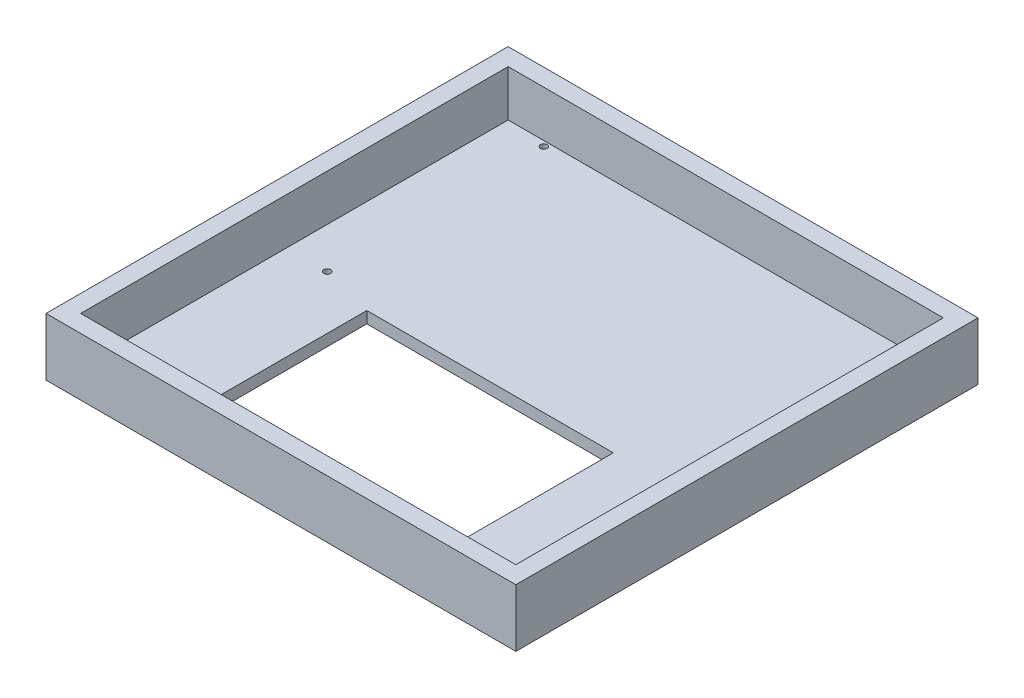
ISO-10303-21;
HEADER;
FILE_DESCRIPTION(('STEP AP214'),'2;1');
FILE_NAME('part.step','',(''),(''),'','','');
FILE_SCHEMA(('AUTOMOTIVE_DESIGN { 1 0 10303 214 1 1 1 1 }'));
ENDSEC;
DATA;
#1=APPLICATION_CONTEXT('core data for automotive mechanical design processes');
#2=APPLICATION_PROTOCOL_DEFINITION('international standard','automotive_design',2000,#1);
#3=PRODUCT_CONTEXT('',#1,'mechanical');
#4=PRODUCT('Part','Part','',(#3));
#5=PRODUCT_RELATED_PRODUCT_CATEGORY('part','',(#4));
#6=PRODUCT_DEFINITION_FORMATION('','',#4);
#7=PRODUCT_DEFINITION_CONTEXT('part definition',#1,'design');
#8=PRODUCT_DEFINITION('design','',#6,#7);
#9=PRODUCT_DEFINITION_SHAPE('','',#8);
#10=(LENGTH_UNIT() NAMED_UNIT(*) SI_UNIT(.MILLI.,.METRE.));
#11=(NAMED_UNIT(*) PLANE_ANGLE_UNIT() SI_UNIT($,.RADIAN.));
#12=(NAMED_UNIT(*) SI_UNIT($,.STERADIAN.) SOLID_ANGLE_UNIT());
#13=UNCERTAINTY_MEASURE_WITH_UNIT(LENGTH_MEASURE(1.E-05),#10,'distance_accuracy_value','');
#14=(GEOMETRIC_REPRESENTATION_CONTEXT(3) GLOBAL_UNCERTAINTY_ASSIGNED_CONTEXT((#13)) GLOBAL_UNIT_ASSIGNED_CONTEXT((#10,
#11,#12)) REPRESENTATION_CONTEXT('',''));
#15=CARTESIAN_POINT('',(0.,0.,0.));
#16=DIRECTION('',(0.,0.,1.));
#17=DIRECTION('',(1.,0.,0.));
#18=AXIS2_PLACEMENT_3D('',#15,#16,#17);
#19=CARTESIAN_POINT('',(0.,15.,0.));
#20=DIRECTION('',(0.,1.,0.));
#21=DIRECTION('',(0.,0.,1.));
#22=AXIS2_PLACEMENT_3D('',#19,#20,#21);
#23=PLANE('',#22);
#24=DIRECTION('',(0.,0.,1.));
#25=VECTOR('',#24,1.);
#26=CARTESIAN_POINT('',(-61.,15.,60.));
#27=LINE('',#26,#25);
#28=CARTESIAN_POINT('',(-61.,15.,-60.));
#29=VERTEX_POINT('',#28);
#30=CARTESIAN_POINT('',(-61.,15.,60.));
#31=VERTEX_POINT('',#30);
#32=EDGE_CURVE('E185',#29,#31,#27,.T.);
#33=ORIENTED_EDGE('',*,*,#32,.T.);
#34=DIRECTION('',(1.,0.,0.));
#35=VECTOR('',#34,1.);
#36=CARTESIAN_POINT('',(61.,15.,60.));
#37=LINE('',#36,#35);
#38=CARTESIAN_POINT('',(61.,15.,60.));
#39=VERTEX_POINT('',#38);
#40=EDGE_CURVE('E188',#31,#39,#37,.T.);
#41=ORIENTED_EDGE('',*,*,#40,.T.);
#42=DIRECTION('',(0.,0.,-1.));
#43=VECTOR('',#42,1.);
#44=CARTESIAN_POINT('',(61.,15.,60.));
#45=LINE('',#44,#43);
#46=CARTESIAN_POINT('',(61.,15.,-60.));
#47=VERTEX_POINT('',#46);
#48=EDGE_CURVE('E191',#39,#47,#45,.T.);
#49=ORIENTED_EDGE('',*,*,#48,.T.);
#50=DIRECTION('',(-1.,0.,0.));
#51=VECTOR('',#50,1.);
#52=CARTESIAN_POINT('',(61.,15.,-60.));
#53=LINE('',#52,#51);
#54=EDGE_CURVE('E193',#47,#29,#53,.T.);
#55=ORIENTED_EDGE('',*,*,#54,.T.);
#56=EDGE_LOOP('',(#33,#41,#49,#55));
#57=FACE_BOUND('',#56,.T.);
#58=DIRECTION('',(0.,0.,-1.));
#59=VECTOR('',#58,1.);
#60=CARTESIAN_POINT('',(56.5,15.,55.5));
#61=LINE('',#60,#59);
#62=CARTESIAN_POINT('',(56.5,15.,55.5));
#63=VERTEX_POINT('',#62);
#64=CARTESIAN_POINT('',(56.5,15.,-55.5));
#65=VERTEX_POINT('',#64);
#66=EDGE_CURVE('E156',#63,#65,#61,.T.);
#67=ORIENTED_EDGE('',*,*,#66,.F.);
#68=DIRECTION('',(-1.,0.,0.));
#69=VECTOR('',#68,1.);
#70=CARTESIAN_POINT('',(56.5,15.,55.5));
#71=LINE('',#70,#69);
#72=CARTESIAN_POINT('',(-56.5,15.,55.5));
#73=VERTEX_POINT('',#72);
#74=EDGE_CURVE('E149',#63,#73,#71,.T.);
#75=ORIENTED_EDGE('',*,*,#74,.T.);
#76=DIRECTION('',(0.,0.,-1.));
#77=VECTOR('',#76,1.);
#78=CARTESIAN_POINT('',(-56.5,15.,55.5));
#79=LINE('',#78,#77);
#80=CARTESIAN_POINT('',(-56.5,15.,-55.5));
#81=VERTEX_POINT('',#80);
#82=EDGE_CURVE('E167',#73,#81,#79,.T.);
#83=ORIENTED_EDGE('',*,*,#82,.T.);
#84=DIRECTION('',(-1.,0.,0.));
#85=VECTOR('',#84,1.);
#86=CARTESIAN_POINT('',(56.5,15.,-55.5));
#87=LINE('',#86,#85);
#88=EDGE_CURVE('E170',#65,#81,#87,.T.);
#89=ORIENTED_EDGE('',*,*,#88,.F.);
#90=EDGE_LOOP('',(#67,#75,#83,#89));
#91=FACE_BOUND('',#90,.T.);
#92=ADVANCED_FACE('F34',(#57,#91),#23,.T.);
#93=CARTESIAN_POINT('',(-61.,15.,60.));
#94=DIRECTION('',(1.,0.,0.));
#95=DIRECTION('',(0.,0.,-1.));
#96=AXIS2_PLACEMENT_3D('',#93,#94,#95);
#97=PLANE('',#96);
#98=DIRECTION('',(0.,0.,1.));
#99=VECTOR('',#98,1.);
#100=CARTESIAN_POINT('',(-61.,0.,60.));
#101=LINE('',#100,#99);
#102=CARTESIAN_POINT('',(-61.,0.,-60.));
#103=VERTEX_POINT('',#102);
#104=CARTESIAN_POINT('',(-61.,0.,60.));
#105=VERTEX_POINT('',#104);
#106=EDGE_CURVE('E184',#103,#105,#101,.T.);
#107=ORIENTED_EDGE('',*,*,#106,.T.);
#108=DIRECTION('',(0.,-1.,0.));
#109=VECTOR('',#108,1.);
#110=CARTESIAN_POINT('',(-61.,15.,60.));
#111=LINE('',#110,#109);
#112=EDGE_CURVE('E211',#31,#105,#111,.T.);
#113=ORIENTED_EDGE('',*,*,#112,.F.);
#114=ORIENTED_EDGE('',*,*,#32,.F.);
#115=DIRECTION('',(0.,-1.,0.));
#116=VECTOR('',#115,1.);
#117=CARTESIAN_POINT('',(-61.,15.,-60.));
#118=LINE('',#117,#116);
#119=EDGE_CURVE('E195',#29,#103,#118,.T.);
#120=ORIENTED_EDGE('',*,*,#119,.T.);
#121=EDGE_LOOP('',(#107,#113,#114,#120));
#122=FACE_BOUND('',#121,.T.);
#123=ADVANCED_FACE('F36',(#122),#97,.F.);
#124=CARTESIAN_POINT('',(61.,15.,60.));
#125=DIRECTION('',(0.,0.,-1.));
#126=DIRECTION('',(-1.,0.,0.));
#127=AXIS2_PLACEMENT_3D('',#124,#125,#126);
#128=PLANE('',#127);
#129=DIRECTION('',(1.,0.,0.));
#130=VECTOR('',#129,1.);
#131=CARTESIAN_POINT('',(61.,0.,60.));
#132=LINE('',#131,#130);
#133=CARTESIAN_POINT('',(61.,0.,60.));
#134=VERTEX_POINT('',#133);
#135=EDGE_CURVE('E198',#105,#134,#132,.T.);
#136=ORIENTED_EDGE('',*,*,#135,.T.);
#137=DIRECTION('',(0.,-1.,0.));
#138=VECTOR('',#137,1.);
#139=CARTESIAN_POINT('',(61.,15.,60.));
#140=LINE('',#139,#138);
#141=EDGE_CURVE('E208',#39,#134,#140,.T.);
#142=ORIENTED_EDGE('',*,*,#141,.F.);
#143=ORIENTED_EDGE('',*,*,#40,.F.);
#144=ORIENTED_EDGE('',*,*,#112,.T.);
#145=EDGE_LOOP('',(#136,#142,#143,#144));
#146=FACE_BOUND('',#145,.T.);
#147=ADVANCED_FACE('F241',(#146),#128,.F.);
#148=CARTESIAN_POINT('',(61.,15.,60.));
#149=DIRECTION('',(-1.,0.,0.));
#150=DIRECTION('',(0.,0.,1.));
#151=AXIS2_PLACEMENT_3D('',#148,#149,#150);
#152=PLANE('',#151);
#153=DIRECTION('',(0.,0.,-1.));
#154=VECTOR('',#153,1.);
#155=CARTESIAN_POINT('',(61.,0.,60.));
#156=LINE('',#155,#154);
#157=CARTESIAN_POINT('',(61.,0.,-60.));
#158=VERTEX_POINT('',#157);
#159=EDGE_CURVE('E200',#134,#158,#156,.T.);
#160=ORIENTED_EDGE('',*,*,#159,.T.);
#161=DIRECTION('',(0.,-1.,0.));
#162=VECTOR('',#161,1.);
#163=CARTESIAN_POINT('',(61.,15.,-60.));
#164=LINE('',#163,#162);
#165=EDGE_CURVE('E205',#47,#158,#164,.T.);
#166=ORIENTED_EDGE('',*,*,#165,.F.);
#167=ORIENTED_EDGE('',*,*,#48,.F.);
#168=ORIENTED_EDGE('',*,*,#141,.T.);
#169=EDGE_LOOP('',(#160,#166,#167,#168));
#170=FACE_BOUND('',#169,.T.);
#171=ADVANCED_FACE('F254',(#170),#152,.F.);
#172=CARTESIAN_POINT('',(61.,15.,-60.));
#173=DIRECTION('',(0.,0.,1.));
#174=DIRECTION('',(1.,0.,0.));
#175=AXIS2_PLACEMENT_3D('',#172,#173,#174);
#176=PLANE('',#175);
#177=DIRECTION('',(-1.,0.,0.));
#178=VECTOR('',#177,1.);
#179=CARTESIAN_POINT('',(61.,0.,-60.));
#180=LINE('',#179,#178);
#181=EDGE_CURVE('E189',#158,#103,#180,.T.);
#182=ORIENTED_EDGE('',*,*,#181,.T.);
#183=ORIENTED_EDGE('',*,*,#119,.F.);
#184=ORIENTED_EDGE('',*,*,#54,.F.);
#185=ORIENTED_EDGE('',*,*,#165,.T.);
#186=EDGE_LOOP('',(#182,#183,#184,#185));
#187=FACE_BOUND('',#186,.T.);
#188=ADVANCED_FACE('F250',(#187),#176,.F.);
#189=CARTESIAN_POINT('',(0.,0.,0.));
#190=DIRECTION('',(0.,1.,0.));
#191=DIRECTION('',(0.,0.,1.));
#192=AXIS2_PLACEMENT_3D('',#189,#190,#191);
#193=PLANE('',#192);
#194=CARTESIAN_POINT('',(-45.8978,0.,2.06199999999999));
#195=DIRECTION('',(0.,1.,0.));
#196=DIRECTION('',(0.,0.,1.));
#197=AXIS2_PLACEMENT_3D('',#194,#195,#196);
#198=CIRCLE('',#197,0.876299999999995);
#199=CARTESIAN_POINT('',(-45.8978,0.,2.93829999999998));
#200=VERTEX_POINT('',#199);
#201=EDGE_CURVE('E390',#200,#200,#198,.T.);
#202=ORIENTED_EDGE('',*,*,#201,.T.);
#203=EDGE_LOOP('',(#202));
#204=FACE_BOUND('',#203,.T.);
#205=CARTESIAN_POINT('',(45.8978,0.,2.06199999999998));
#206=DIRECTION('',(0.,1.,0.));
#207=DIRECTION('',(0.,0.,1.));
#208=AXIS2_PLACEMENT_3D('',#205,#206,#207);
#209=CIRCLE('',#208,0.876299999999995);
#210=CARTESIAN_POINT('',(45.8978,0.,2.93829999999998));
#211=VERTEX_POINT('',#210);
#212=EDGE_CURVE('E394',#211,#211,#209,.T.);
#213=ORIENTED_EDGE('',*,*,#212,.T.);
#214=EDGE_LOOP('',(#213));
#215=FACE_BOUND('',#214,.T.);
#216=CARTESIAN_POINT('',(45.8978,0.,-54.1736));
#217=DIRECTION('',(0.,1.,0.));
#218=DIRECTION('',(0.,0.,1.));
#219=AXIS2_PLACEMENT_3D('',#216,#217,#218);
#220=CIRCLE('',#219,0.876299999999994);
#221=CARTESIAN_POINT('',(45.8978,0.,-53.2973));
#222=VERTEX_POINT('',#221);
#223=EDGE_CURVE('E404',#222,#222,#220,.T.);
#224=ORIENTED_EDGE('',*,*,#223,.T.);
#225=EDGE_LOOP('',(#224));
#226=FACE_BOUND('',#225,.T.);
#227=CARTESIAN_POINT('',(-45.8978,0.,-54.1736));
#228=DIRECTION('',(0.,1.,0.));
#229=DIRECTION('',(0.,0.,1.));
#230=AXIS2_PLACEMENT_3D('',#227,#228,#229);
#231=CIRCLE('',#230,0.876299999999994);
#232=CARTESIAN_POINT('',(-45.8978,0.,-53.2973));
#233=VERTEX_POINT('',#232);
#234=EDGE_CURVE('E410',#233,#233,#231,.T.);
#235=ORIENTED_EDGE('',*,*,#234,.T.);
#236=EDGE_LOOP('',(#235));
#237=FACE_BOUND('',#236,.T.);
#238=DIRECTION('',(1.,0.,0.));
#239=VECTOR('',#238,1.);
#240=CARTESIAN_POINT('',(32.,0.,5.69419999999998));
#241=LINE('',#240,#239);
#242=CARTESIAN_POINT('',(-32.,0.,5.69419999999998));
#243=VERTEX_POINT('',#242);
#244=CARTESIAN_POINT('',(32.,0.,5.69419999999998));
#245=VERTEX_POINT('',#244);
#246=EDGE_CURVE('E135',#243,#245,#241,.T.);
#247=ORIENTED_EDGE('',*,*,#246,.F.);
#248=DIRECTION('',(0.,0.,-1.));
#249=VECTOR('',#248,1.);
#250=CARTESIAN_POINT('',(-32.,0.,51.6942));
#251=LINE('',#250,#249);
#252=CARTESIAN_POINT('',(-32.,0.,51.6942));
#253=VERTEX_POINT('',#252);
#254=EDGE_CURVE('E49',#253,#243,#251,.T.);
#255=ORIENTED_EDGE('',*,*,#254,.F.);
#256=DIRECTION('',(-1.,0.,0.));
#257=VECTOR('',#256,1.);
#258=CARTESIAN_POINT('',(32.,0.,51.6942));
#259=LINE('',#258,#257);
#260=CARTESIAN_POINT('',(32.,0.,51.6942));
#261=VERTEX_POINT('',#260);
#262=EDGE_CURVE('E142',#261,#253,#259,.T.);
#263=ORIENTED_EDGE('',*,*,#262,.F.);
#264=DIRECTION('',(0.,0.,1.));
#265=VECTOR('',#264,1.);
#266=CARTESIAN_POINT('',(32.,0.,51.6942));
#267=LINE('',#266,#265);
#268=EDGE_CURVE('E126',#245,#261,#267,.T.);
#269=ORIENTED_EDGE('',*,*,#268,.F.);
#270=EDGE_LOOP('',(#247,#255,#263,#269));
#271=FACE_BOUND('',#270,.T.);
#272=ORIENTED_EDGE('',*,*,#106,.F.);
#273=ORIENTED_EDGE('',*,*,#181,.F.);
#274=ORIENTED_EDGE('',*,*,#159,.F.);
#275=ORIENTED_EDGE('',*,*,#135,.F.);
#276=EDGE_LOOP('',(#272,#273,#274,#275));
#277=FACE_BOUND('',#276,.T.);
#278=ADVANCED_FACE('F139',(#204,#215,#226,#237,#271,#277),#193,.F.);
#279=CARTESIAN_POINT('',(56.5,3.,55.5));
#280=DIRECTION('',(0.,0.,-1.));
#281=DIRECTION('',(-1.,0.,0.));
#282=AXIS2_PLACEMENT_3D('',#279,#280,#281);
#283=PLANE('',#282);
#284=ORIENTED_EDGE('',*,*,#74,.F.);
#285=DIRECTION('',(0.,1.,0.));
#286=VECTOR('',#285,1.);
#287=CARTESIAN_POINT('',(56.5,3.,55.5));
#288=LINE('',#287,#286);
#289=CARTESIAN_POINT('',(56.5,3.,55.5));
#290=VERTEX_POINT('',#289);
#291=EDGE_CURVE('E164',#290,#63,#288,.T.);
#292=ORIENTED_EDGE('',*,*,#291,.F.);
#293=DIRECTION('',(-1.,0.,0.));
#294=VECTOR('',#293,1.);
#295=CARTESIAN_POINT('',(56.5,3.,55.5));
#296=LINE('',#295,#294);
#297=CARTESIAN_POINT('',(-56.5,3.,55.5));
#298=VERTEX_POINT('',#297);
#299=EDGE_CURVE('E152',#290,#298,#296,.T.);
#300=ORIENTED_EDGE('',*,*,#299,.T.);
#301=DIRECTION('',(0.,1.,0.));
#302=VECTOR('',#301,1.);
#303=CARTESIAN_POINT('',(-56.5,3.,55.5));
#304=LINE('',#303,#302);
#305=EDGE_CURVE('E181',#298,#73,#304,.T.);
#306=ORIENTED_EDGE('',*,*,#305,.T.);
#307=EDGE_LOOP('',(#284,#292,#300,#306));
#308=FACE_BOUND('',#307,.T.);
#309=ADVANCED_FACE('F246',(#308),#283,.T.);
#310=CARTESIAN_POINT('',(-56.5,3.,55.5));
#311=DIRECTION('',(1.,0.,0.));
#312=DIRECTION('',(0.,0.,-1.));
#313=AXIS2_PLACEMENT_3D('',#310,#311,#312);
#314=PLANE('',#313);
#315=ORIENTED_EDGE('',*,*,#82,.F.);
#316=ORIENTED_EDGE('',*,*,#305,.F.);
#317=DIRECTION('',(0.,0.,-1.));
#318=VECTOR('',#317,1.);
#319=CARTESIAN_POINT('',(-56.5,3.,55.5));
#320=LINE('',#319,#318);
#321=CARTESIAN_POINT('',(-56.5,3.,-55.5));
#322=VERTEX_POINT('',#321);
#323=EDGE_CURVE('E155',#298,#322,#320,.T.);
#324=ORIENTED_EDGE('',*,*,#323,.T.);
#325=DIRECTION('',(0.,1.,0.));
#326=VECTOR('',#325,1.);
#327=CARTESIAN_POINT('',(-56.5,3.,-55.5));
#328=LINE('',#327,#326);
#329=EDGE_CURVE('E179',#322,#81,#328,.T.);
#330=ORIENTED_EDGE('',*,*,#329,.T.);
#331=EDGE_LOOP('',(#315,#316,#324,#330));
#332=FACE_BOUND('',#331,.T.);
#333=ADVANCED_FACE('F294',(#332),#314,.T.);
#334=CARTESIAN_POINT('',(56.5,3.,-55.5));
#335=DIRECTION('',(0.,0.,-1.));
#336=DIRECTION('',(-1.,0.,0.));
#337=AXIS2_PLACEMENT_3D('',#334,#335,#336);
#338=PLANE('',#337);
#339=ORIENTED_EDGE('',*,*,#88,.T.);
#340=ORIENTED_EDGE('',*,*,#329,.F.);
#341=DIRECTION('',(-1.,0.,0.));
#342=VECTOR('',#341,1.);
#343=CARTESIAN_POINT('',(56.5,3.,-55.5));
#344=LINE('',#343,#342);
#345=CARTESIAN_POINT('',(56.5,3.,-55.5));
#346=VERTEX_POINT('',#345);
#347=EDGE_CURVE('E158',#346,#322,#344,.T.);
#348=ORIENTED_EDGE('',*,*,#347,.F.);
#349=DIRECTION('',(0.,1.,0.));
#350=VECTOR('',#349,1.);
#351=CARTESIAN_POINT('',(56.5,3.,-55.5));
#352=LINE('',#351,#350);
#353=EDGE_CURVE('E177',#346,#65,#352,.T.);
#354=ORIENTED_EDGE('',*,*,#353,.T.);
#355=EDGE_LOOP('',(#339,#340,#348,#354));
#356=FACE_BOUND('',#355,.T.);
#357=ADVANCED_FACE('F301',(#356),#338,.F.);
#358=CARTESIAN_POINT('',(56.5,3.,55.5));
#359=DIRECTION('',(1.,0.,0.));
#360=DIRECTION('',(0.,0.,-1.));
#361=AXIS2_PLACEMENT_3D('',#358,#359,#360);
#362=PLANE('',#361);
#363=ORIENTED_EDGE('',*,*,#66,.T.);
#364=ORIENTED_EDGE('',*,*,#353,.F.);
#365=DIRECTION('',(0.,0.,-1.));
#366=VECTOR('',#365,1.);
#367=CARTESIAN_POINT('',(56.5,3.,55.5));
#368=LINE('',#367,#366);
#369=EDGE_CURVE('E161',#290,#346,#368,.T.);
#370=ORIENTED_EDGE('',*,*,#369,.F.);
#371=ORIENTED_EDGE('',*,*,#291,.T.);
#372=EDGE_LOOP('',(#363,#364,#370,#371));
#373=FACE_BOUND('',#372,.T.);
#374=ADVANCED_FACE('F231',(#373),#362,.F.);
#375=CARTESIAN_POINT('',(0.,3.,0.));
#376=DIRECTION('',(0.,-1.,0.));
#377=DIRECTION('',(0.,0.,-1.));
#378=AXIS2_PLACEMENT_3D('',#375,#376,#377);
#379=PLANE('',#378);
#380=CARTESIAN_POINT('',(-45.8978,3.,2.06199999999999));
#381=DIRECTION('',(0.,1.,0.));
#382=DIRECTION('',(0.,0.,1.));
#383=AXIS2_PLACEMENT_3D('',#380,#381,#382);
#384=CIRCLE('',#383,0.876299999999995);
#385=CARTESIAN_POINT('',(-45.8978,3.,2.93829999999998));
#386=VERTEX_POINT('',#385);
#387=EDGE_CURVE('E393',#386,#386,#384,.T.);
#388=ORIENTED_EDGE('',*,*,#387,.F.);
#389=EDGE_LOOP('',(#388));
#390=FACE_BOUND('',#389,.T.);
#391=CARTESIAN_POINT('',(45.8978,3.,2.06199999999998));
#392=DIRECTION('',(0.,1.,0.));
#393=DIRECTION('',(0.,0.,1.));
#394=AXIS2_PLACEMENT_3D('',#391,#392,#393);
#395=CIRCLE('',#394,0.876299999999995);
#396=CARTESIAN_POINT('',(45.8978,3.,2.93829999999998));
#397=VERTEX_POINT('',#396);
#398=EDGE_CURVE('E399',#397,#397,#395,.T.);
#399=ORIENTED_EDGE('',*,*,#398,.F.);
#400=EDGE_LOOP('',(#399));
#401=FACE_BOUND('',#400,.T.);
#402=CARTESIAN_POINT('',(45.8978,3.,-54.1736));
#403=DIRECTION('',(0.,1.,0.));
#404=DIRECTION('',(0.,0.,1.));
#405=AXIS2_PLACEMENT_3D('',#402,#403,#404);
#406=CIRCLE('',#405,0.876299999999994);
#407=CARTESIAN_POINT('',(45.8978,3.,-53.2973));
#408=VERTEX_POINT('',#407);
#409=EDGE_CURVE('E407',#408,#408,#406,.T.);
#410=ORIENTED_EDGE('',*,*,#409,.F.);
#411=EDGE_LOOP('',(#410));
#412=FACE_BOUND('',#411,.T.);
#413=CARTESIAN_POINT('',(-45.8978,3.,-54.1736));
#414=DIRECTION('',(0.,1.,0.));
#415=DIRECTION('',(0.,0.,1.));
#416=AXIS2_PLACEMENT_3D('',#413,#414,#415);
#417=CIRCLE('',#416,0.876299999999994);
#418=CARTESIAN_POINT('',(-45.8978,3.,-53.2973));
#419=VERTEX_POINT('',#418);
#420=EDGE_CURVE('E396',#419,#419,#417,.T.);
#421=ORIENTED_EDGE('',*,*,#420,.F.);
#422=EDGE_LOOP('',(#421));
#423=FACE_BOUND('',#422,.T.);
#424=DIRECTION('',(-1.,0.,0.));
#425=VECTOR('',#424,1.);
#426=CARTESIAN_POINT('',(0.,3.,51.6942));
#427=LINE('',#426,#425);
#428=CARTESIAN_POINT('',(32.,3.,51.6942));
#429=VERTEX_POINT('',#428);
#430=CARTESIAN_POINT('',(-32.,3.,51.6942));
#431=VERTEX_POINT('',#430);
#432=EDGE_CURVE('E42',#429,#431,#427,.T.);
#433=ORIENTED_EDGE('',*,*,#432,.T.);
#434=DIRECTION('',(0.,0.,-1.));
#435=VECTOR('',#434,1.);
#436=CARTESIAN_POINT('',(-32.,3.,0.));
#437=LINE('',#436,#435);
#438=CARTESIAN_POINT('',(-32.,3.,5.69419999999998));
#439=VERTEX_POINT('',#438);
#440=EDGE_CURVE('E11',#431,#439,#437,.T.);
#441=ORIENTED_EDGE('',*,*,#440,.T.);
#442=DIRECTION('',(1.,0.,0.));
#443=VECTOR('',#442,1.);
#444=CARTESIAN_POINT('',(0.,3.,5.69419999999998));
#445=LINE('',#444,#443);
#446=CARTESIAN_POINT('',(32.,3.,5.69419999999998));
#447=VERTEX_POINT('',#446);
#448=EDGE_CURVE('E214',#439,#447,#445,.T.);
#449=ORIENTED_EDGE('',*,*,#448,.T.);
#450=DIRECTION('',(0.,0.,1.));
#451=VECTOR('',#450,1.);
#452=CARTESIAN_POINT('',(32.,3.,0.));
#453=LINE('',#452,#451);
#454=EDGE_CURVE('E129',#447,#429,#453,.T.);
#455=ORIENTED_EDGE('',*,*,#454,.T.);
#456=EDGE_LOOP('',(#433,#441,#449,#455));
#457=FACE_BOUND('',#456,.T.);
#458=ORIENTED_EDGE('',*,*,#299,.F.);
#459=ORIENTED_EDGE('',*,*,#369,.T.);
#460=ORIENTED_EDGE('',*,*,#347,.T.);
#461=ORIENTED_EDGE('',*,*,#323,.F.);
#462=EDGE_LOOP('',(#458,#459,#460,#461));
#463=FACE_BOUND('',#462,.T.);
#464=ADVANCED_FACE('F218',(#390,#401,#412,#423,#457,#463),#379,.F.);
#465=CARTESIAN_POINT('',(-32.,15.,51.6942));
#466=DIRECTION('',(-1.,0.,0.));
#467=DIRECTION('',(0.,0.,1.));
#468=AXIS2_PLACEMENT_3D('',#465,#466,#467);
#469=PLANE('',#468);
#470=DIRECTION('',(0.,-1.,0.));
#471=VECTOR('',#470,1.);
#472=CARTESIAN_POINT('',(-32.,15.,51.6942));
#473=LINE('',#472,#471);
#474=EDGE_CURVE('E147',#431,#253,#473,.T.);
#475=ORIENTED_EDGE('',*,*,#474,.T.);
#476=ORIENTED_EDGE('',*,*,#254,.T.);
#477=DIRECTION('',(0.,-1.,0.));
#478=VECTOR('',#477,1.);
#479=CARTESIAN_POINT('',(-32.,15.,5.69419999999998));
#480=LINE('',#479,#478);
#481=EDGE_CURVE('E132',#439,#243,#480,.T.);
#482=ORIENTED_EDGE('',*,*,#481,.F.);
#483=ORIENTED_EDGE('',*,*,#440,.F.);
#484=EDGE_LOOP('',(#475,#476,#482,#483));
#485=FACE_BOUND('',#484,.T.);
#486=ADVANCED_FACE('F223',(#485),#469,.F.);
#487=CARTESIAN_POINT('',(32.,15.,51.6942));
#488=DIRECTION('',(0.,0.,1.));
#489=DIRECTION('',(1.,0.,0.));
#490=AXIS2_PLACEMENT_3D('',#487,#488,#489);
#491=PLANE('',#490);
#492=DIRECTION('',(0.,-1.,0.));
#493=VECTOR('',#492,1.);
#494=CARTESIAN_POINT('',(32.,15.,51.6942));
#495=LINE('',#494,#493);
#496=EDGE_CURVE('E131',#429,#261,#495,.T.);
#497=ORIENTED_EDGE('',*,*,#496,.T.);
#498=ORIENTED_EDGE('',*,*,#262,.T.);
#499=ORIENTED_EDGE('',*,*,#474,.F.);
#500=ORIENTED_EDGE('',*,*,#432,.F.);
#501=EDGE_LOOP('',(#497,#498,#499,#500));
#502=FACE_BOUND('',#501,.T.);
#503=ADVANCED_FACE('F222',(#502),#491,.F.);
#504=CARTESIAN_POINT('',(32.,15.,51.6942));
#505=DIRECTION('',(1.,0.,0.));
#506=DIRECTION('',(0.,0.,-1.));
#507=AXIS2_PLACEMENT_3D('',#504,#505,#506);
#508=PLANE('',#507);
#509=DIRECTION('',(0.,-1.,0.));
#510=VECTOR('',#509,1.);
#511=CARTESIAN_POINT('',(32.,15.,5.69419999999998));
#512=LINE('',#511,#510);
#513=EDGE_CURVE('E57',#447,#245,#512,.T.);
#514=ORIENTED_EDGE('',*,*,#513,.T.);
#515=ORIENTED_EDGE('',*,*,#268,.T.);
#516=ORIENTED_EDGE('',*,*,#496,.F.);
#517=ORIENTED_EDGE('',*,*,#454,.F.);
#518=EDGE_LOOP('',(#514,#515,#516,#517));
#519=FACE_BOUND('',#518,.T.);
#520=ADVANCED_FACE('F123',(#519),#508,.F.);
#521=CARTESIAN_POINT('',(32.,15.,5.69419999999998));
#522=DIRECTION('',(0.,0.,-1.));
#523=DIRECTION('',(-1.,0.,0.));
#524=AXIS2_PLACEMENT_3D('',#521,#522,#523);
#525=PLANE('',#524);
#526=ORIENTED_EDGE('',*,*,#481,.T.);
#527=ORIENTED_EDGE('',*,*,#246,.T.);
#528=ORIENTED_EDGE('',*,*,#513,.F.);
#529=ORIENTED_EDGE('',*,*,#448,.F.);
#530=EDGE_LOOP('',(#526,#527,#528,#529));
#531=FACE_BOUND('',#530,.T.);
#532=ADVANCED_FACE('F136',(#531),#525,.F.);
#533=CARTESIAN_POINT('',(-45.8978,0.,-54.1736));
#534=DIRECTION('',(0.,1.,0.));
#535=DIRECTION('',(0.,0.,1.));
#536=AXIS2_PLACEMENT_3D('',#533,#534,#535);
#537=CYLINDRICAL_SURFACE('',#536,0.876299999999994);
#538=ORIENTED_EDGE('',*,*,#234,.F.);
#539=EDGE_LOOP('',(#538));
#540=FACE_BOUND('',#539,.T.);
#541=ORIENTED_EDGE('',*,*,#420,.T.);
#542=EDGE_LOOP('',(#541));
#543=FACE_BOUND('',#542,.T.);
#544=ADVANCED_FACE('F325',(#540,#543),#537,.F.);
#545=CARTESIAN_POINT('',(45.8978,0.,-54.1736));
#546=DIRECTION('',(0.,1.,0.));
#547=DIRECTION('',(0.,0.,1.));
#548=AXIS2_PLACEMENT_3D('',#545,#546,#547);
#549=CYLINDRICAL_SURFACE('',#548,0.876299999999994);
#550=ORIENTED_EDGE('',*,*,#223,.F.);
#551=EDGE_LOOP('',(#550));
#552=FACE_BOUND('',#551,.T.);
#553=ORIENTED_EDGE('',*,*,#409,.T.);
#554=EDGE_LOOP('',(#553));
#555=FACE_BOUND('',#554,.T.);
#556=ADVANCED_FACE('F330',(#552,#555),#549,.F.);
#557=CARTESIAN_POINT('',(45.8978,0.,2.06199999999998));
#558=DIRECTION('',(0.,1.,0.));
#559=DIRECTION('',(0.,0.,1.));
#560=AXIS2_PLACEMENT_3D('',#557,#558,#559);
#561=CYLINDRICAL_SURFACE('',#560,0.876299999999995);
#562=ORIENTED_EDGE('',*,*,#212,.F.);
#563=EDGE_LOOP('',(#562));
#564=FACE_BOUND('',#563,.T.);
#565=ORIENTED_EDGE('',*,*,#398,.T.);
#566=EDGE_LOOP('',(#565));
#567=FACE_BOUND('',#566,.T.);
#568=ADVANCED_FACE('F342',(#564,#567),#561,.F.);
#569=CARTESIAN_POINT('',(-45.8978,0.,2.06199999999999));
#570=DIRECTION('',(0.,1.,0.));
#571=DIRECTION('',(0.,0.,1.));
#572=AXIS2_PLACEMENT_3D('',#569,#570,#571);
#573=CYLINDRICAL_SURFACE('',#572,0.876299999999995);
#574=ORIENTED_EDGE('',*,*,#201,.F.);
#575=EDGE_LOOP('',(#574));
#576=FACE_BOUND('',#575,.T.);
#577=ORIENTED_EDGE('',*,*,#387,.T.);
#578=EDGE_LOOP('',(#577));
#579=FACE_BOUND('',#578,.T.);
#580=ADVANCED_FACE('F352',(#576,#579),#573,.F.);
#581=CLOSED_SHELL('',(#92,#123,#147,#171,#188,#278,#309,#333,#357,#374,#464,#486,#503,#520,#532,
#544,#556,#568,#580));
#582=MANIFOLD_SOLID_BREP('B2',#581);
#583=ADVANCED_BREP_SHAPE_REPRESENTATION('',(#18,#582),#14);
#584=SHAPE_DEFINITION_REPRESENTATION(#9,#583);
ENDSEC;
END-ISO-10303-21;
